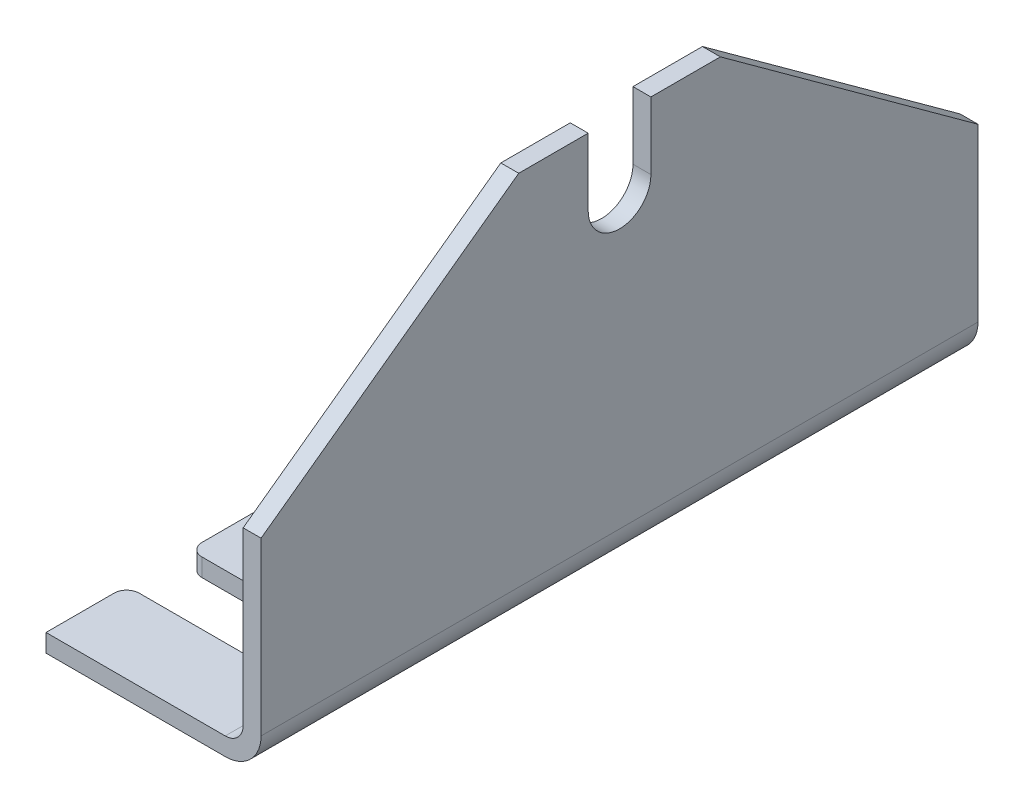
ISO-10303-21;
HEADER;
FILE_DESCRIPTION(('STEP AP214'),'2;1');
FILE_NAME('part.step','',(''),(''),'','','');
FILE_SCHEMA(('AUTOMOTIVE_DESIGN { 1 0 10303 214 1 1 1 1 }'));
ENDSEC;
DATA;
#1=APPLICATION_CONTEXT('core data for automotive mechanical design processes');
#2=APPLICATION_PROTOCOL_DEFINITION('international standard','automotive_design',2000,#1);
#3=PRODUCT_CONTEXT('',#1,'mechanical');
#4=PRODUCT('Part','Part','',(#3));
#5=PRODUCT_RELATED_PRODUCT_CATEGORY('part','',(#4));
#6=PRODUCT_DEFINITION_FORMATION('','',#4);
#7=PRODUCT_DEFINITION_CONTEXT('part definition',#1,'design');
#8=PRODUCT_DEFINITION('design','',#6,#7);
#9=PRODUCT_DEFINITION_SHAPE('','',#8);
#10=(LENGTH_UNIT() NAMED_UNIT(*) SI_UNIT(.MILLI.,.METRE.));
#11=(NAMED_UNIT(*) PLANE_ANGLE_UNIT() SI_UNIT($,.RADIAN.));
#12=(NAMED_UNIT(*) SI_UNIT($,.STERADIAN.) SOLID_ANGLE_UNIT());
#13=UNCERTAINTY_MEASURE_WITH_UNIT(LENGTH_MEASURE(1.E-05),#10,'distance_accuracy_value','');
#14=(GEOMETRIC_REPRESENTATION_CONTEXT(3) GLOBAL_UNCERTAINTY_ASSIGNED_CONTEXT((#13)) GLOBAL_UNIT_ASSIGNED_CONTEXT((#10,
#11,#12)) REPRESENTATION_CONTEXT('',''));
#15=CARTESIAN_POINT('',(0.,0.,0.));
#16=DIRECTION('',(0.,0.,1.));
#17=DIRECTION('',(1.,0.,0.));
#18=AXIS2_PLACEMENT_3D('',#15,#16,#17);
#19=CARTESIAN_POINT('',(-25.1999999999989,0.,62.));
#20=DIRECTION('',(0.,0.,1.));
#21=DIRECTION('',(0.,-1.,0.));
#22=AXIS2_PLACEMENT_3D('',#19,#20,#21);
#23=PLANE('',#22);
#24=DIRECTION('',(-1.,0.,0.));
#25=VECTOR('',#24,1.);
#26=CARTESIAN_POINT('',(11.9999999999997,4.00000000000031,62.));
#27=LINE('',#26,#25);
#28=CARTESIAN_POINT('',(0.,4.00000000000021,62.));
#29=VERTEX_POINT('',#28);
#30=CARTESIAN_POINT('',(-25.1999999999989,4.00000000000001,62.));
#31=VERTEX_POINT('',#30);
#32=EDGE_CURVE('E320',#29,#31,#27,.T.);
#33=ORIENTED_EDGE('',*,*,#32,.F.);
#34=DIRECTION('',(0.,1.,0.));
#35=VECTOR('',#34,1.);
#36=CARTESIAN_POINT('',(0.,0.,62.));
#37=LINE('',#36,#35);
#38=CARTESIAN_POINT('',(0.,0.,62.));
#39=VERTEX_POINT('',#38);
#40=EDGE_CURVE('E274',#29,#39,#37,.F.);
#41=ORIENTED_EDGE('',*,*,#40,.T.);
#42=DIRECTION('',(1.,0.,0.));
#43=VECTOR('',#42,1.);
#44=CARTESIAN_POINT('',(-28.,0.,62.));
#45=LINE('',#44,#43);
#46=CARTESIAN_POINT('',(-25.1999999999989,0.,62.));
#47=VERTEX_POINT('',#46);
#48=EDGE_CURVE('E258',#47,#39,#45,.T.);
#49=ORIENTED_EDGE('',*,*,#48,.F.);
#50=DIRECTION('',(0.,1.,0.));
#51=VECTOR('',#50,1.);
#52=CARTESIAN_POINT('',(-25.1999999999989,0.,62.));
#53=LINE('',#52,#51);
#54=EDGE_CURVE('E200',#31,#47,#53,.F.);
#55=ORIENTED_EDGE('',*,*,#54,.F.);
#56=EDGE_LOOP('',(#33,#41,#49,#55));
#57=FACE_BOUND('',#56,.T.);
#58=ADVANCED_FACE('F17',(#57),#23,.F.);
#59=CARTESIAN_POINT('',(0.,0.,55.));
#60=DIRECTION('',(0.,1.,0.));
#61=DIRECTION('',(0.,0.,1.));
#62=AXIS2_PLACEMENT_3D('',#59,#60,#61);
#63=CYLINDRICAL_SURFACE('',#62,7.);
#64=CARTESIAN_POINT('',(0.,4.00000000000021,55.));
#65=DIRECTION('',(0.,1.,0.));
#66=DIRECTION('',(0.,0.,1.));
#67=AXIS2_PLACEMENT_3D('',#64,#65,#66);
#68=CIRCLE('',#67,7.);
#69=CARTESIAN_POINT('',(0.,4.00000000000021,48.));
#70=VERTEX_POINT('',#69);
#71=EDGE_CURVE('E321',#70,#29,#68,.F.);
#72=ORIENTED_EDGE('',*,*,#71,.F.);
#73=DIRECTION('',(0.,1.,0.));
#74=VECTOR('',#73,1.);
#75=CARTESIAN_POINT('',(0.,0.,48.));
#76=LINE('',#75,#74);
#77=CARTESIAN_POINT('',(0.,0.,48.));
#78=VERTEX_POINT('',#77);
#79=EDGE_CURVE('E272',#70,#78,#76,.F.);
#80=ORIENTED_EDGE('',*,*,#79,.T.);
#81=CARTESIAN_POINT('',(0.,0.,55.));
#82=DIRECTION('',(0.,1.,0.));
#83=DIRECTION('',(0.,0.,1.));
#84=AXIS2_PLACEMENT_3D('',#81,#82,#83);
#85=CIRCLE('',#84,7.);
#86=EDGE_CURVE('E315',#39,#78,#85,.T.);
#87=ORIENTED_EDGE('',*,*,#86,.F.);
#88=ORIENTED_EDGE('',*,*,#40,.F.);
#89=EDGE_LOOP('',(#72,#80,#87,#88));
#90=FACE_BOUND('',#89,.T.);
#91=ADVANCED_FACE('F529',(#90),#63,.F.);
#92=CARTESIAN_POINT('',(0.,0.,48.));
#93=DIRECTION('',(0.,0.,-1.));
#94=DIRECTION('',(0.,1.,0.));
#95=AXIS2_PLACEMENT_3D('',#92,#93,#94);
#96=PLANE('',#95);
#97=DIRECTION('',(-1.,0.,0.));
#98=VECTOR('',#97,1.);
#99=CARTESIAN_POINT('',(11.9999999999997,4.00000000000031,48.));
#100=LINE('',#99,#98);
#101=CARTESIAN_POINT('',(-25.1999999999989,4.00000000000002,48.));
#102=VERTEX_POINT('',#101);
#103=EDGE_CURVE('E324',#102,#70,#100,.F.);
#104=ORIENTED_EDGE('',*,*,#103,.F.);
#105=DIRECTION('',(0.,1.,0.));
#106=VECTOR('',#105,1.);
#107=CARTESIAN_POINT('',(-25.1999999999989,0.,48.));
#108=LINE('',#107,#106);
#109=CARTESIAN_POINT('',(-25.1999999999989,0.,48.));
#110=VERTEX_POINT('',#109);
#111=EDGE_CURVE('E270',#110,#102,#108,.T.);
#112=ORIENTED_EDGE('',*,*,#111,.F.);
#113=DIRECTION('',(1.,0.,0.));
#114=VECTOR('',#113,1.);
#115=CARTESIAN_POINT('',(-28.,0.,48.));
#116=LINE('',#115,#114);
#117=EDGE_CURVE('E314',#78,#110,#116,.F.);
#118=ORIENTED_EDGE('',*,*,#117,.F.);
#119=ORIENTED_EDGE('',*,*,#79,.F.);
#120=EDGE_LOOP('',(#104,#112,#118,#119));
#121=FACE_BOUND('',#120,.T.);
#122=ADVANCED_FACE('F534',(#121),#96,.F.);
#123=CARTESIAN_POINT('',(-25.1999999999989,0.,45.1999999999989));
#124=DIRECTION('',(0.,1.,0.));
#125=DIRECTION('',(0.,0.,1.));
#126=AXIS2_PLACEMENT_3D('',#123,#124,#125);
#127=CYLINDRICAL_SURFACE('',#126,2.80000000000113);
#128=DIRECTION('',(0.,-1.,0.));
#129=VECTOR('',#128,1.);
#130=CARTESIAN_POINT('',(-28.,4.,45.1999999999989));
#131=LINE('',#130,#129);
#132=CARTESIAN_POINT('',(-28.,0.,45.1999999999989));
#133=VERTEX_POINT('',#132);
#134=CARTESIAN_POINT('',(-28.,4.00000000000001,45.1999999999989));
#135=VERTEX_POINT('',#134);
#136=EDGE_CURVE('E268',#133,#135,#131,.F.);
#137=ORIENTED_EDGE('',*,*,#136,.F.);
#138=CARTESIAN_POINT('',(-25.1999999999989,0.,45.1999999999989));
#139=DIRECTION('',(0.,1.,0.));
#140=DIRECTION('',(0.,0.,1.));
#141=AXIS2_PLACEMENT_3D('',#138,#139,#140);
#142=CIRCLE('',#141,2.80000000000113);
#143=EDGE_CURVE('E311',#110,#133,#142,.F.);
#144=ORIENTED_EDGE('',*,*,#143,.F.);
#145=ORIENTED_EDGE('',*,*,#111,.T.);
#146=CARTESIAN_POINT('',(-25.1999999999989,4.00000000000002,45.1999999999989));
#147=DIRECTION('',(0.,1.,0.));
#148=DIRECTION('',(0.,0.,1.));
#149=AXIS2_PLACEMENT_3D('',#146,#147,#148);
#150=CIRCLE('',#149,2.80000000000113);
#151=EDGE_CURVE('E325',#135,#102,#150,.T.);
#152=ORIENTED_EDGE('',*,*,#151,.F.);
#153=EDGE_LOOP('',(#137,#144,#145,#152));
#154=FACE_BOUND('',#153,.T.);
#155=ADVANCED_FACE('F537',(#154),#127,.T.);
#156=CARTESIAN_POINT('',(-28.,4.,-80.));
#157=DIRECTION('',(-1.,0.,0.));
#158=DIRECTION('',(0.,-1.,0.));
#159=AXIS2_PLACEMENT_3D('',#156,#157,#158);
#160=PLANE('',#159);
#161=DIRECTION('',(0.,0.,-1.));
#162=VECTOR('',#161,1.);
#163=CARTESIAN_POINT('',(-28.,0.,-80.));
#164=LINE('',#163,#162);
#165=CARTESIAN_POINT('',(-28.,0.,-45.1999999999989));
#166=VERTEX_POINT('',#165);
#167=EDGE_CURVE('E310',#133,#166,#164,.T.);
#168=ORIENTED_EDGE('',*,*,#167,.F.);
#169=ORIENTED_EDGE('',*,*,#136,.T.);
#170=DIRECTION('',(0.,0.,1.));
#171=VECTOR('',#170,1.);
#172=CARTESIAN_POINT('',(-28.,4.,-80.));
#173=LINE('',#172,#171);
#174=CARTESIAN_POINT('',(-28.,4.,-45.1999999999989));
#175=VERTEX_POINT('',#174);
#176=EDGE_CURVE('E328',#175,#135,#173,.T.);
#177=ORIENTED_EDGE('',*,*,#176,.F.);
#178=DIRECTION('',(0.,1.,0.));
#179=VECTOR('',#178,1.);
#180=CARTESIAN_POINT('',(-28.,0.,-45.1999999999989));
#181=LINE('',#180,#179);
#182=EDGE_CURVE('E266',#166,#175,#181,.T.);
#183=ORIENTED_EDGE('',*,*,#182,.F.);
#184=EDGE_LOOP('',(#168,#169,#177,#183));
#185=FACE_BOUND('',#184,.T.);
#186=ADVANCED_FACE('F541',(#185),#160,.T.);
#187=CARTESIAN_POINT('',(-25.1999999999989,0.,-45.1999999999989));
#188=DIRECTION('',(0.,1.,0.));
#189=DIRECTION('',(0.,0.,1.));
#190=AXIS2_PLACEMENT_3D('',#187,#188,#189);
#191=CYLINDRICAL_SURFACE('',#190,2.80000000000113);
#192=DIRECTION('',(0.,1.,0.));
#193=VECTOR('',#192,1.);
#194=CARTESIAN_POINT('',(-25.1999999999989,0.,-48.));
#195=LINE('',#194,#193);
#196=CARTESIAN_POINT('',(-25.1999999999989,4.00000000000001,-48.));
#197=VERTEX_POINT('',#196);
#198=CARTESIAN_POINT('',(-25.1999999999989,0.,-48.));
#199=VERTEX_POINT('',#198);
#200=EDGE_CURVE('E264',#197,#199,#195,.F.);
#201=ORIENTED_EDGE('',*,*,#200,.T.);
#202=CARTESIAN_POINT('',(-25.1999999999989,0.,-45.1999999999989));
#203=DIRECTION('',(0.,1.,0.));
#204=DIRECTION('',(0.,0.,1.));
#205=AXIS2_PLACEMENT_3D('',#202,#203,#204);
#206=CIRCLE('',#205,2.80000000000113);
#207=EDGE_CURVE('E307',#166,#199,#206,.F.);
#208=ORIENTED_EDGE('',*,*,#207,.F.);
#209=ORIENTED_EDGE('',*,*,#182,.T.);
#210=CARTESIAN_POINT('',(-25.1999999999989,4.,-45.1999999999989));
#211=DIRECTION('',(0.,1.,0.));
#212=DIRECTION('',(0.,0.,1.));
#213=AXIS2_PLACEMENT_3D('',#210,#211,#212);
#214=CIRCLE('',#213,2.80000000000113);
#215=EDGE_CURVE('E329',#197,#175,#214,.T.);
#216=ORIENTED_EDGE('',*,*,#215,.F.);
#217=EDGE_LOOP('',(#201,#208,#209,#216));
#218=FACE_BOUND('',#217,.T.);
#219=ADVANCED_FACE('F545',(#218),#191,.T.);
#220=CARTESIAN_POINT('',(-25.1999999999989,0.,-48.));
#221=DIRECTION('',(0.,0.,1.));
#222=DIRECTION('',(1.,0.,0.));
#223=AXIS2_PLACEMENT_3D('',#220,#221,#222);
#224=PLANE('',#223);
#225=DIRECTION('',(-1.,0.,0.));
#226=VECTOR('',#225,1.);
#227=CARTESIAN_POINT('',(11.9999999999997,4.00000000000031,-48.));
#228=LINE('',#227,#226);
#229=CARTESIAN_POINT('',(0.,4.00000000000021,-48.));
#230=VERTEX_POINT('',#229);
#231=EDGE_CURVE('E331',#230,#197,#228,.T.);
#232=ORIENTED_EDGE('',*,*,#231,.F.);
#233=DIRECTION('',(0.,1.,0.));
#234=VECTOR('',#233,1.);
#235=CARTESIAN_POINT('',(0.,0.,-48.));
#236=LINE('',#235,#234);
#237=CARTESIAN_POINT('',(0.,0.,-48.));
#238=VERTEX_POINT('',#237);
#239=EDGE_CURVE('E262',#230,#238,#236,.F.);
#240=ORIENTED_EDGE('',*,*,#239,.T.);
#241=DIRECTION('',(1.,0.,0.));
#242=VECTOR('',#241,1.);
#243=CARTESIAN_POINT('',(-28.,0.,-48.));
#244=LINE('',#243,#242);
#245=EDGE_CURVE('E306',#199,#238,#244,.T.);
#246=ORIENTED_EDGE('',*,*,#245,.F.);
#247=ORIENTED_EDGE('',*,*,#200,.F.);
#248=EDGE_LOOP('',(#232,#240,#246,#247));
#249=FACE_BOUND('',#248,.T.);
#250=ADVANCED_FACE('F548',(#249),#224,.F.);
#251=CARTESIAN_POINT('',(0.,0.,-55.));
#252=DIRECTION('',(0.,1.,0.));
#253=DIRECTION('',(0.,0.,1.));
#254=AXIS2_PLACEMENT_3D('',#251,#252,#253);
#255=CYLINDRICAL_SURFACE('',#254,7.);
#256=CARTESIAN_POINT('',(0.,4.00000000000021,-55.));
#257=DIRECTION('',(0.,1.,0.));
#258=DIRECTION('',(0.,0.,1.));
#259=AXIS2_PLACEMENT_3D('',#256,#257,#258);
#260=CIRCLE('',#259,7.);
#261=CARTESIAN_POINT('',(0.,4.00000000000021,-62.));
#262=VERTEX_POINT('',#261);
#263=EDGE_CURVE('E209',#262,#230,#260,.F.);
#264=ORIENTED_EDGE('',*,*,#263,.F.);
#265=DIRECTION('',(0.,1.,0.));
#266=VECTOR('',#265,1.);
#267=CARTESIAN_POINT('',(0.,0.,-62.));
#268=LINE('',#267,#266);
#269=CARTESIAN_POINT('',(0.,0.,-62.));
#270=VERTEX_POINT('',#269);
#271=EDGE_CURVE('E201',#262,#270,#268,.F.);
#272=ORIENTED_EDGE('',*,*,#271,.T.);
#273=CARTESIAN_POINT('',(0.,0.,-55.));
#274=DIRECTION('',(0.,1.,0.));
#275=DIRECTION('',(0.,0.,1.));
#276=AXIS2_PLACEMENT_3D('',#273,#274,#275);
#277=CIRCLE('',#276,7.);
#278=EDGE_CURVE('E303',#238,#270,#277,.T.);
#279=ORIENTED_EDGE('',*,*,#278,.F.);
#280=ORIENTED_EDGE('',*,*,#239,.F.);
#281=EDGE_LOOP('',(#264,#272,#279,#280));
#282=FACE_BOUND('',#281,.T.);
#283=ADVANCED_FACE('F551',(#282),#255,.F.);
#284=CARTESIAN_POINT('',(0.,0.,-62.));
#285=DIRECTION('',(0.,0.,-1.));
#286=DIRECTION('',(0.,1.,0.));
#287=AXIS2_PLACEMENT_3D('',#284,#285,#286);
#288=PLANE('',#287);
#289=DIRECTION('',(-1.,0.,0.));
#290=VECTOR('',#289,1.);
#291=CARTESIAN_POINT('',(11.9999999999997,4.00000000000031,-62.));
#292=LINE('',#291,#290);
#293=CARTESIAN_POINT('',(-25.1999999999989,4.00000000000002,-62.));
#294=VERTEX_POINT('',#293);
#295=EDGE_CURVE('E204',#294,#262,#292,.F.);
#296=ORIENTED_EDGE('',*,*,#295,.F.);
#297=DIRECTION('',(0.,1.,0.));
#298=VECTOR('',#297,1.);
#299=CARTESIAN_POINT('',(-25.1999999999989,0.,-62.));
#300=LINE('',#299,#298);
#301=CARTESIAN_POINT('',(-25.1999999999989,0.,-62.));
#302=VERTEX_POINT('',#301);
#303=EDGE_CURVE('E190',#302,#294,#300,.T.);
#304=ORIENTED_EDGE('',*,*,#303,.F.);
#305=DIRECTION('',(1.,0.,0.));
#306=VECTOR('',#305,1.);
#307=CARTESIAN_POINT('',(-28.,0.,-62.));
#308=LINE('',#307,#306);
#309=EDGE_CURVE('E302',#270,#302,#308,.F.);
#310=ORIENTED_EDGE('',*,*,#309,.F.);
#311=ORIENTED_EDGE('',*,*,#271,.F.);
#312=EDGE_LOOP('',(#296,#304,#310,#311));
#313=FACE_BOUND('',#312,.T.);
#314=ADVANCED_FACE('F205',(#313),#288,.F.);
#315=CARTESIAN_POINT('',(-25.1999999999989,0.,-64.8000000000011));
#316=DIRECTION('',(0.,1.,0.));
#317=DIRECTION('',(0.,0.,1.));
#318=AXIS2_PLACEMENT_3D('',#315,#316,#317);
#319=CYLINDRICAL_SURFACE('',#318,2.80000000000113);
#320=DIRECTION('',(0.,-1.,0.));
#321=VECTOR('',#320,1.);
#322=CARTESIAN_POINT('',(-28.,4.,-64.8000000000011));
#323=LINE('',#322,#321);
#324=CARTESIAN_POINT('',(-28.,0.,-64.8000000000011));
#325=VERTEX_POINT('',#324);
#326=CARTESIAN_POINT('',(-28.,4.00000000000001,-64.8000000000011));
#327=VERTEX_POINT('',#326);
#328=EDGE_CURVE('E185',#325,#327,#323,.F.);
#329=ORIENTED_EDGE('',*,*,#328,.F.);
#330=CARTESIAN_POINT('',(-25.1999999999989,0.,-64.8000000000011));
#331=DIRECTION('',(0.,1.,0.));
#332=DIRECTION('',(0.,0.,1.));
#333=AXIS2_PLACEMENT_3D('',#330,#331,#332);
#334=CIRCLE('',#333,2.80000000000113);
#335=EDGE_CURVE('E196',#302,#325,#334,.F.);
#336=ORIENTED_EDGE('',*,*,#335,.F.);
#337=ORIENTED_EDGE('',*,*,#303,.T.);
#338=CARTESIAN_POINT('',(-25.1999999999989,4.00000000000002,-64.8000000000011));
#339=DIRECTION('',(0.,1.,0.));
#340=DIRECTION('',(0.,0.,1.));
#341=AXIS2_PLACEMENT_3D('',#338,#339,#340);
#342=CIRCLE('',#341,2.80000000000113);
#343=EDGE_CURVE('E20',#327,#294,#342,.T.);
#344=ORIENTED_EDGE('',*,*,#343,.F.);
#345=EDGE_LOOP('',(#329,#336,#337,#344));
#346=FACE_BOUND('',#345,.T.);
#347=ADVANCED_FACE('F192',(#346),#319,.T.);
#348=CARTESIAN_POINT('',(-25.1999999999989,0.,64.8000000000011));
#349=DIRECTION('',(0.,1.,0.));
#350=DIRECTION('',(0.,0.,1.));
#351=AXIS2_PLACEMENT_3D('',#348,#349,#350);
#352=CYLINDRICAL_SURFACE('',#351,2.80000000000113);
#353=ORIENTED_EDGE('',*,*,#54,.T.);
#354=CARTESIAN_POINT('',(-25.1999999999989,0.,64.8000000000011));
#355=DIRECTION('',(0.,1.,0.));
#356=DIRECTION('',(0.,0.,1.));
#357=AXIS2_PLACEMENT_3D('',#354,#355,#356);
#358=CIRCLE('',#357,2.80000000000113);
#359=CARTESIAN_POINT('',(-28.,0.,64.8000000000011));
#360=VERTEX_POINT('',#359);
#361=EDGE_CURVE('E295',#360,#47,#358,.F.);
#362=ORIENTED_EDGE('',*,*,#361,.F.);
#363=DIRECTION('',(0.,-1.,0.));
#364=VECTOR('',#363,1.);
#365=CARTESIAN_POINT('',(-28.,4.,64.8000000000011));
#366=LINE('',#365,#364);
#367=CARTESIAN_POINT('',(-28.,4.,64.8000000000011));
#368=VERTEX_POINT('',#367);
#369=EDGE_CURVE('E257',#368,#360,#366,.T.);
#370=ORIENTED_EDGE('',*,*,#369,.F.);
#371=CARTESIAN_POINT('',(-25.1999999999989,4.,64.8000000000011));
#372=DIRECTION('',(0.,1.,0.));
#373=DIRECTION('',(0.,0.,1.));
#374=AXIS2_PLACEMENT_3D('',#371,#372,#373);
#375=CIRCLE('',#374,2.80000000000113);
#376=EDGE_CURVE('E318',#31,#368,#375,.T.);
#377=ORIENTED_EDGE('',*,*,#376,.F.);
#378=EDGE_LOOP('',(#353,#362,#370,#377));
#379=FACE_BOUND('',#378,.T.);
#380=ADVANCED_FACE('F522',(#379),#352,.T.);
#381=CARTESIAN_POINT('',(-28.,4.,-80.));
#382=DIRECTION('',(-1.,0.,0.));
#383=DIRECTION('',(0.,-1.,0.));
#384=AXIS2_PLACEMENT_3D('',#381,#382,#383);
#385=PLANE('',#384);
#386=DIRECTION('',(0.,0.,-1.));
#387=VECTOR('',#386,1.);
#388=CARTESIAN_POINT('',(-28.,0.,-80.));
#389=LINE('',#388,#387);
#390=CARTESIAN_POINT('',(-28.,0.,-80.));
#391=VERTEX_POINT('',#390);
#392=EDGE_CURVE('E301',#325,#391,#389,.T.);
#393=ORIENTED_EDGE('',*,*,#392,.F.);
#394=ORIENTED_EDGE('',*,*,#328,.T.);
#395=DIRECTION('',(0.,0.,1.));
#396=VECTOR('',#395,1.);
#397=CARTESIAN_POINT('',(-28.,4.,-80.));
#398=LINE('',#397,#396);
#399=CARTESIAN_POINT('',(-28.,4.0000000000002,-80.));
#400=VERTEX_POINT('',#399);
#401=EDGE_CURVE('E214',#400,#327,#398,.T.);
#402=ORIENTED_EDGE('',*,*,#401,.F.);
#403=DIRECTION('',(0.,1.,0.));
#404=VECTOR('',#403,1.);
#405=CARTESIAN_POINT('',(-28.,0.,-80.));
#406=LINE('',#405,#404);
#407=EDGE_CURVE('E226',#400,#391,#406,.F.);
#408=ORIENTED_EDGE('',*,*,#407,.T.);
#409=EDGE_LOOP('',(#393,#394,#402,#408));
#410=FACE_BOUND('',#409,.T.);
#411=ADVANCED_FACE('F515',(#410),#385,.T.);
#412=CARTESIAN_POINT('',(11.9999999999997,4.00000000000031,-80.));
#413=DIRECTION('',(0.,1.,0.));
#414=DIRECTION('',(-1.,0.,0.));
#415=AXIS2_PLACEMENT_3D('',#412,#413,#414);
#416=PLANE('',#415);
#417=ORIENTED_EDGE('',*,*,#32,.T.);
#418=ORIENTED_EDGE('',*,*,#376,.T.);
#419=DIRECTION('',(0.,0.,1.));
#420=VECTOR('',#419,1.);
#421=CARTESIAN_POINT('',(-28.,4.,-80.));
#422=LINE('',#421,#420);
#423=CARTESIAN_POINT('',(-28.,4.0000000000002,80.));
#424=VERTEX_POINT('',#423);
#425=EDGE_CURVE('E259',#424,#368,#422,.F.);
#426=ORIENTED_EDGE('',*,*,#425,.F.);
#427=DIRECTION('',(1.,0.,0.));
#428=VECTOR('',#427,1.);
#429=CARTESIAN_POINT('',(0.,4.00000000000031,80.));
#430=LINE('',#429,#428);
#431=CARTESIAN_POINT('',(11.9999999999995,4.00000000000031,80.));
#432=VERTEX_POINT('',#431);
#433=EDGE_CURVE('E288',#432,#424,#430,.F.);
#434=ORIENTED_EDGE('',*,*,#433,.F.);
#435=DIRECTION('',(0.,0.,1.));
#436=VECTOR('',#435,1.);
#437=CARTESIAN_POINT('',(11.9999999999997,4.00000000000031,-80.));
#438=LINE('',#437,#436);
#439=CARTESIAN_POINT('',(11.9999999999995,4.00000000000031,-80.));
#440=VERTEX_POINT('',#439);
#441=EDGE_CURVE('E221',#432,#440,#438,.F.);
#442=ORIENTED_EDGE('',*,*,#441,.T.);
#443=DIRECTION('',(1.,0.,0.));
#444=VECTOR('',#443,1.);
#445=CARTESIAN_POINT('',(0.,4.00000000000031,-80.));
#446=LINE('',#445,#444);
#447=EDGE_CURVE('E229',#440,#400,#446,.F.);
#448=ORIENTED_EDGE('',*,*,#447,.T.);
#449=ORIENTED_EDGE('',*,*,#401,.T.);
#450=ORIENTED_EDGE('',*,*,#343,.T.);
#451=ORIENTED_EDGE('',*,*,#295,.T.);
#452=ORIENTED_EDGE('',*,*,#263,.T.);
#453=ORIENTED_EDGE('',*,*,#231,.T.);
#454=ORIENTED_EDGE('',*,*,#215,.T.);
#455=ORIENTED_EDGE('',*,*,#176,.T.);
#456=ORIENTED_EDGE('',*,*,#151,.T.);
#457=ORIENTED_EDGE('',*,*,#103,.T.);
#458=ORIENTED_EDGE('',*,*,#71,.T.);
#459=EDGE_LOOP('',(#417,#418,#426,#434,#442,#448,#449,#450,#451,#452,#453,#454,#455,#456,#457,#458));
#460=FACE_BOUND('',#459,.T.);
#461=ADVANCED_FACE('F212',(#460),#416,.T.);
#462=CARTESIAN_POINT('',(-28.,4.,-80.));
#463=DIRECTION('',(-1.,0.,0.));
#464=DIRECTION('',(0.,-1.,0.));
#465=AXIS2_PLACEMENT_3D('',#462,#463,#464);
#466=PLANE('',#465);
#467=ORIENTED_EDGE('',*,*,#425,.T.);
#468=ORIENTED_EDGE('',*,*,#369,.T.);
#469=DIRECTION('',(0.,0.,-1.));
#470=VECTOR('',#469,1.);
#471=CARTESIAN_POINT('',(-28.,0.,-80.));
#472=LINE('',#471,#470);
#473=CARTESIAN_POINT('',(-28.,0.,80.));
#474=VERTEX_POINT('',#473);
#475=EDGE_CURVE('E299',#474,#360,#472,.T.);
#476=ORIENTED_EDGE('',*,*,#475,.F.);
#477=DIRECTION('',(0.,1.,0.));
#478=VECTOR('',#477,1.);
#479=CARTESIAN_POINT('',(-28.,0.,80.));
#480=LINE('',#479,#478);
#481=EDGE_CURVE('E346',#424,#474,#480,.F.);
#482=ORIENTED_EDGE('',*,*,#481,.F.);
#483=EDGE_LOOP('',(#467,#468,#476,#482));
#484=FACE_BOUND('',#483,.T.);
#485=ADVANCED_FACE('F518',(#484),#466,.T.);
#486=CARTESIAN_POINT('',(-28.,0.,-80.));
#487=DIRECTION('',(0.,-1.,0.));
#488=DIRECTION('',(0.,0.,-1.));
#489=AXIS2_PLACEMENT_3D('',#486,#487,#488);
#490=PLANE('',#489);
#491=ORIENTED_EDGE('',*,*,#475,.T.);
#492=ORIENTED_EDGE('',*,*,#361,.T.);
#493=ORIENTED_EDGE('',*,*,#48,.T.);
#494=ORIENTED_EDGE('',*,*,#86,.T.);
#495=ORIENTED_EDGE('',*,*,#117,.T.);
#496=ORIENTED_EDGE('',*,*,#143,.T.);
#497=ORIENTED_EDGE('',*,*,#167,.T.);
#498=ORIENTED_EDGE('',*,*,#207,.T.);
#499=ORIENTED_EDGE('',*,*,#245,.T.);
#500=ORIENTED_EDGE('',*,*,#278,.T.);
#501=ORIENTED_EDGE('',*,*,#309,.T.);
#502=ORIENTED_EDGE('',*,*,#335,.T.);
#503=ORIENTED_EDGE('',*,*,#392,.T.);
#504=DIRECTION('',(1.,0.,0.));
#505=VECTOR('',#504,1.);
#506=CARTESIAN_POINT('',(0.,0.,-80.));
#507=LINE('',#506,#505);
#508=CARTESIAN_POINT('',(11.9999999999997,0.,-80.));
#509=VERTEX_POINT('',#508);
#510=EDGE_CURVE('E228',#391,#509,#507,.T.);
#511=ORIENTED_EDGE('',*,*,#510,.T.);
#512=DIRECTION('',(0.,0.,1.));
#513=VECTOR('',#512,1.);
#514=CARTESIAN_POINT('',(12.,0.,-80.));
#515=LINE('',#514,#513);
#516=CARTESIAN_POINT('',(11.9999999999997,0.,80.));
#517=VERTEX_POINT('',#516);
#518=EDGE_CURVE('E298',#517,#509,#515,.F.);
#519=ORIENTED_EDGE('',*,*,#518,.F.);
#520=DIRECTION('',(1.,0.,0.));
#521=VECTOR('',#520,1.);
#522=CARTESIAN_POINT('',(0.,0.,80.));
#523=LINE('',#522,#521);
#524=EDGE_CURVE('E285',#474,#517,#523,.T.);
#525=ORIENTED_EDGE('',*,*,#524,.F.);
#526=EDGE_LOOP('',(#491,#492,#493,#494,#495,#496,#497,#498,#499,#500,#501,#502,#503,#511,#519,#525));
#527=FACE_BOUND('',#526,.T.);
#528=ADVANCED_FACE('F514',(#527),#490,.T.);
#529=CARTESIAN_POINT('',(11.9999999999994,8.00000000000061,-80.));
#530=DIRECTION('',(0.,0.,1.));
#531=DIRECTION('',(1.,0.,0.));
#532=AXIS2_PLACEMENT_3D('',#529,#530,#531);
#533=CYLINDRICAL_SURFACE('',#532,8.00000000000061);
#534=ORIENTED_EDGE('',*,*,#518,.T.);
#535=CARTESIAN_POINT('',(11.9999999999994,8.00000000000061,-80.));
#536=DIRECTION('',(0.,0.,1.));
#537=DIRECTION('',(1.,0.,0.));
#538=AXIS2_PLACEMENT_3D('',#535,#536,#537);
#539=CIRCLE('',#538,8.00000000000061);
#540=CARTESIAN_POINT('',(20.,8.00000000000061,-80.));
#541=VERTEX_POINT('',#540);
#542=EDGE_CURVE('E291',#509,#541,#539,.T.);
#543=ORIENTED_EDGE('',*,*,#542,.T.);
#544=DIRECTION('',(0.,0.,-1.));
#545=VECTOR('',#544,1.);
#546=CARTESIAN_POINT('',(20.,8.00000000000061,-80.));
#547=LINE('',#546,#545);
#548=CARTESIAN_POINT('',(20.,8.00000000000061,80.));
#549=VERTEX_POINT('',#548);
#550=EDGE_CURVE('E368',#549,#541,#547,.T.);
#551=ORIENTED_EDGE('',*,*,#550,.F.);
#552=CARTESIAN_POINT('',(11.9999999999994,8.00000000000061,80.));
#553=DIRECTION('',(0.,0.,1.));
#554=DIRECTION('',(1.,0.,0.));
#555=AXIS2_PLACEMENT_3D('',#552,#553,#554);
#556=CIRCLE('',#555,8.00000000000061);
#557=EDGE_CURVE('E281',#517,#549,#556,.T.);
#558=ORIENTED_EDGE('',*,*,#557,.F.);
#559=EDGE_LOOP('',(#534,#543,#551,#558));
#560=FACE_BOUND('',#559,.T.);
#561=ADVANCED_FACE('F510',(#560),#533,.T.);
#562=CARTESIAN_POINT('',(20.,8.00000000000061,-80.));
#563=DIRECTION('',(1.,0.,0.));
#564=DIRECTION('',(0.,0.,-1.));
#565=AXIS2_PLACEMENT_3D('',#562,#563,#564);
#566=PLANE('',#565);
#567=DIRECTION('',(0.,0.,1.));
#568=VECTOR('',#567,1.);
#569=CARTESIAN_POINT('',(20.,88.,-80.));
#570=LINE('',#569,#568);
#571=CARTESIAN_POINT('',(20.,88.,22.5000000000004));
#572=VERTEX_POINT('',#571);
#573=CARTESIAN_POINT('',(20.,88.,7.));
#574=VERTEX_POINT('',#573);
#575=EDGE_CURVE('E252',#572,#574,#570,.F.);
#576=ORIENTED_EDGE('',*,*,#575,.F.);
#577=DIRECTION('',(0.,0.587785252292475,-0.809016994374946));
#578=VECTOR('',#577,1.);
#579=CARTESIAN_POINT('',(20.,42.591091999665,85.));
#580=LINE('',#579,#578);
#581=CARTESIAN_POINT('',(20.,46.2238046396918,80.));
#582=VERTEX_POINT('',#581);
#583=EDGE_CURVE('E373',#572,#582,#580,.F.);
#584=ORIENTED_EDGE('',*,*,#583,.T.);
#585=DIRECTION('',(0.,1.,0.));
#586=VECTOR('',#585,1.);
#587=CARTESIAN_POINT('',(20.,0.,80.));
#588=LINE('',#587,#586);
#589=EDGE_CURVE('E284',#549,#582,#588,.T.);
#590=ORIENTED_EDGE('',*,*,#589,.F.);
#591=ORIENTED_EDGE('',*,*,#550,.T.);
#592=DIRECTION('',(0.,1.,0.));
#593=VECTOR('',#592,1.);
#594=CARTESIAN_POINT('',(20.,0.,-80.));
#595=LINE('',#594,#593);
#596=CARTESIAN_POINT('',(20.,46.2238046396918,-80.));
#597=VERTEX_POINT('',#596);
#598=EDGE_CURVE('E290',#541,#597,#595,.T.);
#599=ORIENTED_EDGE('',*,*,#598,.T.);
#600=DIRECTION('',(0.,-0.587785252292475,-0.809016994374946));
#601=VECTOR('',#600,1.);
#602=CARTESIAN_POINT('',(20.,90.,-19.747236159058));
#603=LINE('',#602,#601);
#604=CARTESIAN_POINT('',(20.,88.,-22.5000000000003));
#605=VERTEX_POINT('',#604);
#606=EDGE_CURVE('E232',#597,#605,#603,.F.);
#607=ORIENTED_EDGE('',*,*,#606,.T.);
#608=DIRECTION('',(0.,0.,1.));
#609=VECTOR('',#608,1.);
#610=CARTESIAN_POINT('',(20.,88.,-80.));
#611=LINE('',#610,#609);
#612=CARTESIAN_POINT('',(20.,88.,-7.));
#613=VERTEX_POINT('',#612);
#614=EDGE_CURVE('E238',#613,#605,#611,.F.);
#615=ORIENTED_EDGE('',*,*,#614,.F.);
#616=DIRECTION('',(0.,1.,0.));
#617=VECTOR('',#616,1.);
#618=CARTESIAN_POINT('',(20.,73.,-7.));
#619=LINE('',#618,#617);
#620=CARTESIAN_POINT('',(20.,73.,-7.));
#621=VERTEX_POINT('',#620);
#622=EDGE_CURVE('E244',#613,#621,#619,.F.);
#623=ORIENTED_EDGE('',*,*,#622,.T.);
#624=CARTESIAN_POINT('',(20.,73.,0.));
#625=DIRECTION('',(1.,0.,0.));
#626=DIRECTION('',(0.,0.,-1.));
#627=AXIS2_PLACEMENT_3D('',#624,#625,#626);
#628=CIRCLE('',#627,7.);
#629=CARTESIAN_POINT('',(20.,73.,7.));
#630=VERTEX_POINT('',#629);
#631=EDGE_CURVE('E293',#621,#630,#628,.F.);
#632=ORIENTED_EDGE('',*,*,#631,.T.);
#633=DIRECTION('',(0.,1.,0.));
#634=VECTOR('',#633,1.);
#635=CARTESIAN_POINT('',(20.,90.,7.));
#636=LINE('',#635,#634);
#637=EDGE_CURVE('E249',#630,#574,#636,.T.);
#638=ORIENTED_EDGE('',*,*,#637,.T.);
#639=EDGE_LOOP('',(#576,#584,#590,#591,#599,#607,#615,#623,#632,#638));
#640=FACE_BOUND('',#639,.T.);
#641=ADVANCED_FACE('F506',(#640),#566,.T.);
#642=CARTESIAN_POINT('',(20.,88.,-80.));
#643=DIRECTION('',(0.,1.,0.));
#644=DIRECTION('',(0.,0.,1.));
#645=AXIS2_PLACEMENT_3D('',#642,#643,#644);
#646=PLANE('',#645);
#647=DIRECTION('',(0.,0.,1.));
#648=VECTOR('',#647,1.);
#649=CARTESIAN_POINT('',(16.,88.,-80.));
#650=LINE('',#649,#648);
#651=CARTESIAN_POINT('',(16.,88.,22.5000000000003));
#652=VERTEX_POINT('',#651);
#653=CARTESIAN_POINT('',(16.,88.,7.));
#654=VERTEX_POINT('',#653);
#655=EDGE_CURVE('E376',#652,#654,#650,.F.);
#656=ORIENTED_EDGE('',*,*,#655,.F.);
#657=DIRECTION('',(1.,0.,0.));
#658=VECTOR('',#657,1.);
#659=CARTESIAN_POINT('',(15.9,88.,22.5000000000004));
#660=LINE('',#659,#658);
#661=EDGE_CURVE('E377',#652,#572,#660,.T.);
#662=ORIENTED_EDGE('',*,*,#661,.T.);
#663=ORIENTED_EDGE('',*,*,#575,.T.);
#664=DIRECTION('',(1.,0.,0.));
#665=VECTOR('',#664,1.);
#666=CARTESIAN_POINT('',(15.9,88.,7.));
#667=LINE('',#666,#665);
#668=EDGE_CURVE('E251',#574,#654,#667,.F.);
#669=ORIENTED_EDGE('',*,*,#668,.T.);
#670=EDGE_LOOP('',(#656,#662,#663,#669));
#671=FACE_BOUND('',#670,.T.);
#672=ADVANCED_FACE('F495',(#671),#646,.T.);
#673=CARTESIAN_POINT('',(15.9,90.,7.));
#674=DIRECTION('',(0.,0.,1.));
#675=DIRECTION('',(1.,0.,0.));
#676=AXIS2_PLACEMENT_3D('',#673,#674,#675);
#677=PLANE('',#676);
#678=DIRECTION('',(0.,1.,0.));
#679=VECTOR('',#678,1.);
#680=CARTESIAN_POINT('',(16.,88.,7.00000000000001));
#681=LINE('',#680,#679);
#682=CARTESIAN_POINT('',(16.,73.,7.));
#683=VERTEX_POINT('',#682);
#684=EDGE_CURVE('E280',#654,#683,#681,.F.);
#685=ORIENTED_EDGE('',*,*,#684,.F.);
#686=ORIENTED_EDGE('',*,*,#668,.F.);
#687=ORIENTED_EDGE('',*,*,#637,.F.);
#688=DIRECTION('',(1.,0.,0.));
#689=VECTOR('',#688,1.);
#690=CARTESIAN_POINT('',(15.9,73.,7.));
#691=LINE('',#690,#689);
#692=EDGE_CURVE('E246',#630,#683,#691,.F.);
#693=ORIENTED_EDGE('',*,*,#692,.T.);
#694=EDGE_LOOP('',(#685,#686,#687,#693));
#695=FACE_BOUND('',#694,.T.);
#696=ADVANCED_FACE('F500',(#695),#677,.F.);
#697=CARTESIAN_POINT('',(15.9,73.,0.));
#698=DIRECTION('',(1.,0.,0.));
#699=DIRECTION('',(0.,0.,-1.));
#700=AXIS2_PLACEMENT_3D('',#697,#698,#699);
#701=CYLINDRICAL_SURFACE('',#700,7.);
#702=CARTESIAN_POINT('',(16.,73.,0.));
#703=DIRECTION('',(1.,0.,0.));
#704=DIRECTION('',(0.,0.,-1.));
#705=AXIS2_PLACEMENT_3D('',#702,#703,#704);
#706=CIRCLE('',#705,7.);
#707=CARTESIAN_POINT('',(16.,73.,-7.));
#708=VERTEX_POINT('',#707);
#709=EDGE_CURVE('E276',#683,#708,#706,.T.);
#710=ORIENTED_EDGE('',*,*,#709,.F.);
#711=ORIENTED_EDGE('',*,*,#692,.F.);
#712=ORIENTED_EDGE('',*,*,#631,.F.);
#713=DIRECTION('',(-1.,0.,0.));
#714=VECTOR('',#713,1.);
#715=CARTESIAN_POINT('',(15.9,73.,-7.));
#716=LINE('',#715,#714);
#717=EDGE_CURVE('E241',#621,#708,#716,.T.);
#718=ORIENTED_EDGE('',*,*,#717,.T.);
#719=EDGE_LOOP('',(#710,#711,#712,#718));
#720=FACE_BOUND('',#719,.T.);
#721=ADVANCED_FACE('F504',(#720),#701,.F.);
#722=CARTESIAN_POINT('',(15.9,73.,-7.));
#723=DIRECTION('',(0.,0.,-1.));
#724=DIRECTION('',(-1.,0.,0.));
#725=AXIS2_PLACEMENT_3D('',#722,#723,#724);
#726=PLANE('',#725);
#727=DIRECTION('',(0.,1.,0.));
#728=VECTOR('',#727,1.);
#729=CARTESIAN_POINT('',(16.,88.,-7.00000000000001));
#730=LINE('',#729,#728);
#731=CARTESIAN_POINT('',(16.,88.,-7.00000000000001));
#732=VERTEX_POINT('',#731);
#733=EDGE_CURVE('E279',#708,#732,#730,.T.);
#734=ORIENTED_EDGE('',*,*,#733,.F.);
#735=ORIENTED_EDGE('',*,*,#717,.F.);
#736=ORIENTED_EDGE('',*,*,#622,.F.);
#737=DIRECTION('',(1.,0.,0.));
#738=VECTOR('',#737,1.);
#739=CARTESIAN_POINT('',(20.,88.,-7.00000000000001));
#740=LINE('',#739,#738);
#741=EDGE_CURVE('E235',#732,#613,#740,.T.);
#742=ORIENTED_EDGE('',*,*,#741,.F.);
#743=EDGE_LOOP('',(#734,#735,#736,#742));
#744=FACE_BOUND('',#743,.T.);
#745=ADVANCED_FACE('F468',(#744),#726,.F.);
#746=CARTESIAN_POINT('',(20.,88.,-80.));
#747=DIRECTION('',(0.,1.,0.));
#748=DIRECTION('',(0.,0.,1.));
#749=AXIS2_PLACEMENT_3D('',#746,#747,#748);
#750=PLANE('',#749);
#751=DIRECTION('',(0.,0.,1.));
#752=VECTOR('',#751,1.);
#753=CARTESIAN_POINT('',(16.,88.,-80.));
#754=LINE('',#753,#752);
#755=CARTESIAN_POINT('',(16.,88.,-22.5000000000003));
#756=VERTEX_POINT('',#755);
#757=EDGE_CURVE('E401',#732,#756,#754,.F.);
#758=ORIENTED_EDGE('',*,*,#757,.F.);
#759=ORIENTED_EDGE('',*,*,#741,.T.);
#760=ORIENTED_EDGE('',*,*,#614,.T.);
#761=DIRECTION('',(1.,0.,0.));
#762=VECTOR('',#761,1.);
#763=CARTESIAN_POINT('',(15.9,88.,-22.5000000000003));
#764=LINE('',#763,#762);
#765=EDGE_CURVE('E234',#605,#756,#764,.F.);
#766=ORIENTED_EDGE('',*,*,#765,.T.);
#767=EDGE_LOOP('',(#758,#759,#760,#766));
#768=FACE_BOUND('',#767,.T.);
#769=ADVANCED_FACE('F471',(#768),#750,.T.);
#770=CARTESIAN_POINT('',(15.9,90.,-19.747236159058));
#771=DIRECTION('',(0.,-0.809016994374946,0.587785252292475));
#772=DIRECTION('',(0.,-0.587785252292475,-0.809016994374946));
#773=AXIS2_PLACEMENT_3D('',#770,#771,#772);
#774=PLANE('',#773);
#775=ORIENTED_EDGE('',*,*,#765,.F.);
#776=ORIENTED_EDGE('',*,*,#606,.F.);
#777=DIRECTION('',(1.,0.,0.));
#778=VECTOR('',#777,1.);
#779=CARTESIAN_POINT('',(0.,46.2238046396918,-80.));
#780=LINE('',#779,#778);
#781=CARTESIAN_POINT('',(16.,46.2238046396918,-80.));
#782=VERTEX_POINT('',#781);
#783=EDGE_CURVE('E408',#597,#782,#780,.F.);
#784=ORIENTED_EDGE('',*,*,#783,.T.);
#785=DIRECTION('',(0.,-0.587785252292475,-0.809016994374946));
#786=VECTOR('',#785,1.);
#787=CARTESIAN_POINT('',(16.,88.,-22.5000000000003));
#788=LINE('',#787,#786);
#789=EDGE_CURVE('E404',#756,#782,#788,.T.);
#790=ORIENTED_EDGE('',*,*,#789,.F.);
#791=EDGE_LOOP('',(#775,#776,#784,#790));
#792=FACE_BOUND('',#791,.T.);
#793=ADVANCED_FACE('F475',(#792),#774,.F.);
#794=CARTESIAN_POINT('',(0.,0.,-80.));
#795=DIRECTION('',(0.,0.,1.));
#796=DIRECTION('',(1.,0.,0.));
#797=AXIS2_PLACEMENT_3D('',#794,#795,#796);
#798=PLANE('',#797);
#799=ORIENTED_EDGE('',*,*,#542,.F.);
#800=ORIENTED_EDGE('',*,*,#510,.F.);
#801=ORIENTED_EDGE('',*,*,#407,.F.);
#802=ORIENTED_EDGE('',*,*,#447,.F.);
#803=CARTESIAN_POINT('',(11.9999999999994,8.00000000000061,-80.));
#804=DIRECTION('',(0.,0.,1.));
#805=DIRECTION('',(1.,0.,0.));
#806=AXIS2_PLACEMENT_3D('',#803,#804,#805);
#807=CIRCLE('',#806,4.00000000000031);
#808=CARTESIAN_POINT('',(16.,8.00000000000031,-80.));
#809=VERTEX_POINT('',#808);
#810=EDGE_CURVE('E225',#440,#809,#807,.T.);
#811=ORIENTED_EDGE('',*,*,#810,.T.);
#812=DIRECTION('',(0.,1.,0.));
#813=VECTOR('',#812,1.);
#814=CARTESIAN_POINT('',(16.,88.,-80.));
#815=LINE('',#814,#813);
#816=EDGE_CURVE('E413',#782,#809,#815,.F.);
#817=ORIENTED_EDGE('',*,*,#816,.F.);
#818=ORIENTED_EDGE('',*,*,#783,.F.);
#819=ORIENTED_EDGE('',*,*,#598,.F.);
#820=EDGE_LOOP('',(#799,#800,#801,#802,#811,#817,#818,#819));
#821=FACE_BOUND('',#820,.T.);
#822=ADVANCED_FACE('F481',(#821),#798,.F.);
#823=CARTESIAN_POINT('',(11.9999999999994,8.00000000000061,-80.));
#824=DIRECTION('',(0.,0.,1.));
#825=DIRECTION('',(1.,0.,0.));
#826=AXIS2_PLACEMENT_3D('',#823,#824,#825);
#827=CYLINDRICAL_SURFACE('',#826,4.00000000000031);
#828=CARTESIAN_POINT('',(11.9999999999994,8.00000000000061,80.));
#829=DIRECTION('',(0.,0.,1.));
#830=DIRECTION('',(1.,0.,0.));
#831=AXIS2_PLACEMENT_3D('',#828,#829,#830);
#832=CIRCLE('',#831,4.00000000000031);
#833=CARTESIAN_POINT('',(16.,8.00000000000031,80.));
#834=VERTEX_POINT('',#833);
#835=EDGE_CURVE('E224',#834,#432,#832,.F.);
#836=ORIENTED_EDGE('',*,*,#835,.F.);
#837=DIRECTION('',(0.,0.,1.));
#838=VECTOR('',#837,1.);
#839=CARTESIAN_POINT('',(16.,8.00000000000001,-80.));
#840=LINE('',#839,#838);
#841=EDGE_CURVE('E431',#809,#834,#840,.T.);
#842=ORIENTED_EDGE('',*,*,#841,.F.);
#843=ORIENTED_EDGE('',*,*,#810,.F.);
#844=ORIENTED_EDGE('',*,*,#441,.F.);
#845=EDGE_LOOP('',(#836,#842,#843,#844));
#846=FACE_BOUND('',#845,.T.);
#847=ADVANCED_FACE('F486',(#846),#827,.F.);
#848=CARTESIAN_POINT('',(0.,0.,80.));
#849=DIRECTION('',(0.,0.,1.));
#850=DIRECTION('',(1.,0.,0.));
#851=AXIS2_PLACEMENT_3D('',#848,#849,#850);
#852=PLANE('',#851);
#853=ORIENTED_EDGE('',*,*,#589,.T.);
#854=DIRECTION('',(1.,0.,0.));
#855=VECTOR('',#854,1.);
#856=CARTESIAN_POINT('',(15.9,46.2238046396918,80.));
#857=LINE('',#856,#855);
#858=CARTESIAN_POINT('',(16.,46.2238046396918,80.));
#859=VERTEX_POINT('',#858);
#860=EDGE_CURVE('E35',#582,#859,#857,.F.);
#861=ORIENTED_EDGE('',*,*,#860,.T.);
#862=DIRECTION('',(0.,1.,0.));
#863=VECTOR('',#862,1.);
#864=CARTESIAN_POINT('',(16.,88.,80.));
#865=LINE('',#864,#863);
#866=EDGE_CURVE('E26',#834,#859,#865,.T.);
#867=ORIENTED_EDGE('',*,*,#866,.F.);
#868=ORIENTED_EDGE('',*,*,#835,.T.);
#869=ORIENTED_EDGE('',*,*,#433,.T.);
#870=ORIENTED_EDGE('',*,*,#481,.T.);
#871=ORIENTED_EDGE('',*,*,#524,.T.);
#872=ORIENTED_EDGE('',*,*,#557,.T.);
#873=EDGE_LOOP('',(#853,#861,#867,#868,#869,#870,#871,#872));
#874=FACE_BOUND('',#873,.T.);
#875=ADVANCED_FACE('F488',(#874),#852,.T.);
#876=CARTESIAN_POINT('',(15.9,42.591091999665,85.));
#877=DIRECTION('',(0.,-0.809016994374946,-0.587785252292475));
#878=DIRECTION('',(0.,0.587785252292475,-0.809016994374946));
#879=AXIS2_PLACEMENT_3D('',#876,#877,#878);
#880=PLANE('',#879);
#881=ORIENTED_EDGE('',*,*,#661,.F.);
#882=DIRECTION('',(0.,0.587785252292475,-0.809016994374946));
#883=VECTOR('',#882,1.);
#884=CARTESIAN_POINT('',(16.,46.2238046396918,80.));
#885=LINE('',#884,#883);
#886=EDGE_CURVE('E11',#859,#652,#885,.T.);
#887=ORIENTED_EDGE('',*,*,#886,.F.);
#888=ORIENTED_EDGE('',*,*,#860,.F.);
#889=ORIENTED_EDGE('',*,*,#583,.F.);
#890=EDGE_LOOP('',(#881,#887,#888,#889));
#891=FACE_BOUND('',#890,.T.);
#892=ADVANCED_FACE('F492',(#891),#880,.F.);
#893=CARTESIAN_POINT('',(16.,88.,-80.));
#894=DIRECTION('',(-1.,0.,0.));
#895=DIRECTION('',(0.,0.,1.));
#896=AXIS2_PLACEMENT_3D('',#893,#894,#895);
#897=PLANE('',#896);
#898=ORIENTED_EDGE('',*,*,#866,.T.);
#899=ORIENTED_EDGE('',*,*,#886,.T.);
#900=ORIENTED_EDGE('',*,*,#655,.T.);
#901=ORIENTED_EDGE('',*,*,#684,.T.);
#902=ORIENTED_EDGE('',*,*,#709,.T.);
#903=ORIENTED_EDGE('',*,*,#733,.T.);
#904=ORIENTED_EDGE('',*,*,#757,.T.);
#905=ORIENTED_EDGE('',*,*,#789,.T.);
#906=ORIENTED_EDGE('',*,*,#816,.T.);
#907=ORIENTED_EDGE('',*,*,#841,.T.);
#908=EDGE_LOOP('',(#898,#899,#900,#901,#902,#903,#904,#905,#906,#907));
#909=FACE_BOUND('',#908,.T.);
#910=ADVANCED_FACE('F463',(#909),#897,.T.);
#911=CLOSED_SHELL('',(#58,#91,#122,#155,#186,#219,#250,#283,#314,#347,#380,#411,#461,#485,#528,
#561,#641,#672,#696,#721,#745,#769,#793,#822,#847,#875,#892,#910));
#912=MANIFOLD_SOLID_BREP('B1',#911);
#913=ADVANCED_BREP_SHAPE_REPRESENTATION('',(#18,#912),#14);
#914=SHAPE_DEFINITION_REPRESENTATION(#9,#913);
ENDSEC;
END-ISO-10303-21;
